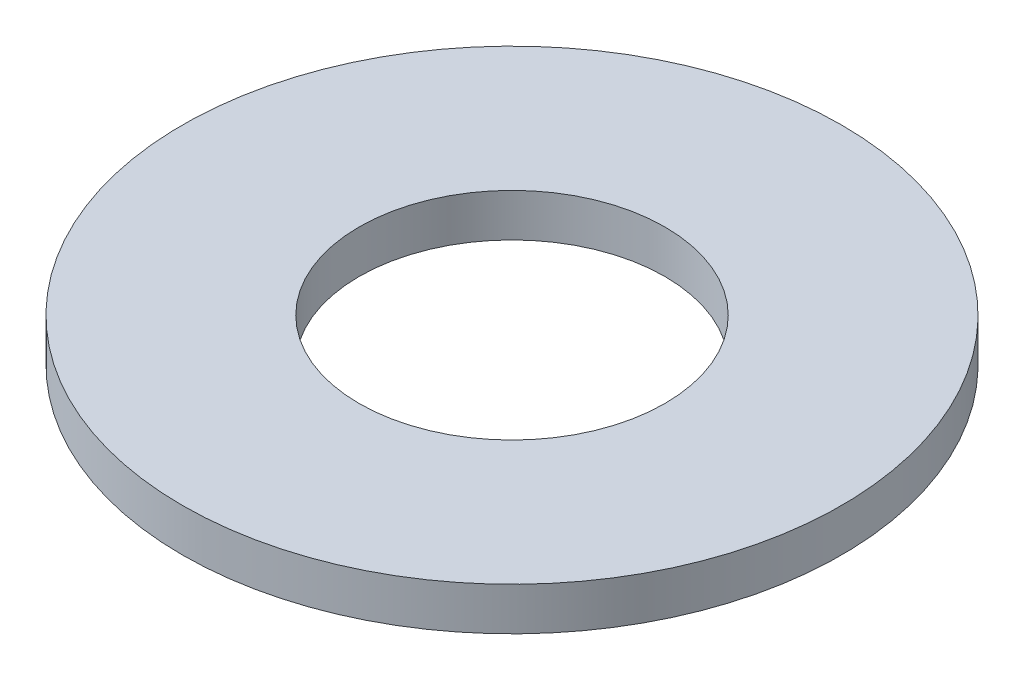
from build123d import *

# Parameters (mm, degrees)
SKETCH1_R           = 11.1125
BOSS_EXTRUDE1_DEPTH = 1.4478
SKETCH5_R           = 5.1562
CUT_EXTRUDE1_DEPTH  = 16.781997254


with BuildPart() as part:
    # Sketch1 → Boss-Extrude1 (new body)
    with BuildSketch(Plane(origin=(0, 0, 0), x_dir=(1, 0, 0), z_dir=(0, 1, 0))):
        with Locations(Location((0, 0, 0), (0, 0, 270))):
            Circle(SKETCH1_R)
    extrude(amount=BOSS_EXTRUDE1_DEPTH)

    # Sketch5 → Cut-Extrude1 (cut, through all)
    with BuildSketch(Plane(origin=(0, 1.4478, 0), x_dir=(-1, 0, 0), z_dir=(0, 1, 0))):
        with Locations(Location((0, 0, 0), (0, 0, 90))):
            Circle(SKETCH5_R)
    extrude(amount=-CUT_EXTRUDE1_DEPTH, mode=Mode.SUBTRACT)


solid = part.part
